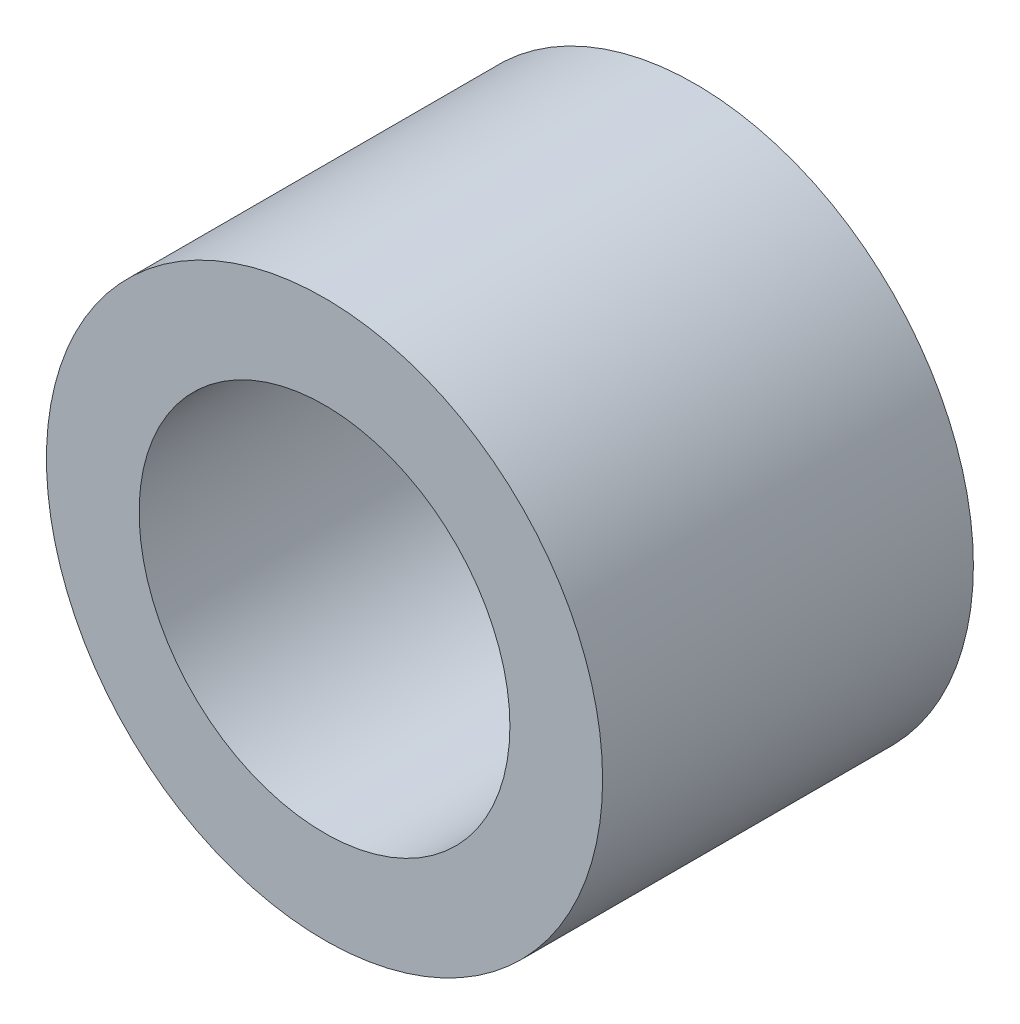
from build123d import *

# Parameters (mm, degrees)
SKETCH1_R           = 3
BOSS_EXTRUDE1_DEPTH = 4
SKETCH2_R           = 2
CUT_EXTRUDE1_DEPTH  = 6.830951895


with BuildPart() as part:
    # Sketch1 → Boss-Extrude1 (new body)
    with BuildSketch(Plane.XY):
        Circle(SKETCH1_R)
    extrude(amount=BOSS_EXTRUDE1_DEPTH)

    # Sketch2 → Cut-Extrude1 (cut, through all)
    with BuildSketch(Plane.XY.offset(4)):
        Circle(SKETCH2_R)
    extrude(amount=-CUT_EXTRUDE1_DEPTH, mode=Mode.SUBTRACT)


solid = part.part
